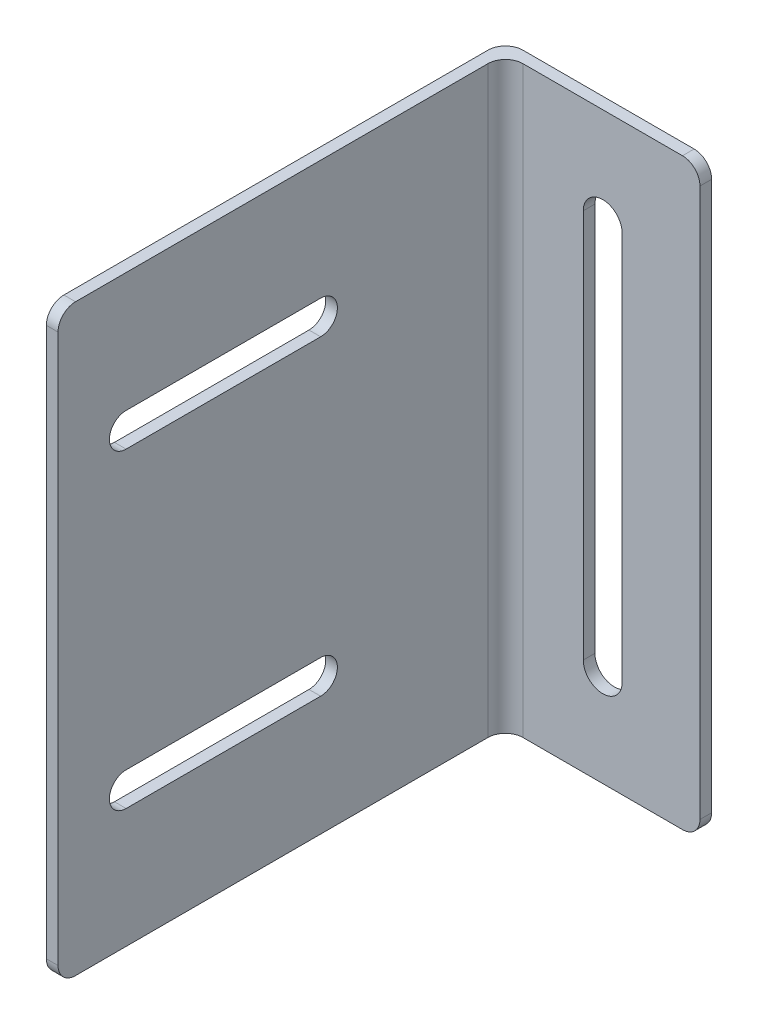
from build123d import *

# Parameters (mm, degrees)
ESQUISSE1_W      = 50
ESQUISSE1_H      = 150
EXTRUSION1_DEPTH = 3
ESQUISSE2_W      = 115
ESQUISSE2_H      = 150
ESQUISSE2_W_2    = 3
EXTRUSION2_DEPTH = 3
CONG_1_R         = 4.5


with BuildPart() as part:
    # Esquisse1 → Extrusion1 (new body)
    with BuildSketch(Plane.XY):
        with Locations((0, 50)):
            Rectangle(ESQUISSE1_W, ESQUISSE1_H)
        with BuildLine():
            Line((-5, 0), (-5, 100))
            ThreePointArc((-5, 100), (0, 105), (5, 100))
            Line((5, 100), (5, 0))
            ThreePointArc((5, 0), (0, -5), (-5, 0))
        make_face(mode=Mode.SUBTRACT)
    extrude(amount=EXTRUSION1_DEPTH)

    # Esquisse2 → Extrusion2 (add)
    # profile 1 of 2: a face of its own
    with BuildSketch(Plane.ZY.offset(25)):
        with Locations((60.5, 50)):
            Rectangle(ESQUISSE2_W, ESQUISSE2_H)
        with BuildLine():
            ThreePointArc((100.5, 5.7), (104.8, 10), (100.5, 14.3))
            Line((100.5, 14.3), (50.5, 14.3))
            ThreePointArc((50.5, 14.3), (46.2, 10), (50.5, 5.7))
            Line((50.5, 5.7), (100.5, 5.7))
        make_face(mode=Mode.SUBTRACT)
        with BuildLine():
            ThreePointArc((100.5, 85.7), (104.8, 90), (100.5, 94.3))
            Line((100.5, 94.3), (50.5, 94.3))
            ThreePointArc((50.5, 94.3), (46.2, 90), (50.5, 85.7))
            Line((50.5, 85.7), (100.5, 85.7))
        make_face(mode=Mode.SUBTRACT)
    # profile 2 of 2: a face of its own
    with BuildSketch(Plane.ZY.offset(25)):
        with Locations((1.5, 50)):
            Rectangle(ESQUISSE2_W_2, ESQUISSE2_H)
    extrude(amount=EXTRUSION2_DEPTH)

    # Cong_1
    cong_1_edges = [part.edges().sort_by_distance(p)[0] for p in [
        (-26.5, -25, 118),
        (-26.5, 125, 118),
        (25, 125, 1.5),
        (25, -25, 1.5),
        (-25, 50, 3),
        (-28, 50, 0),
    ]]
    fillet(cong_1_edges, radius=CONG_1_R)


solid = part.part
